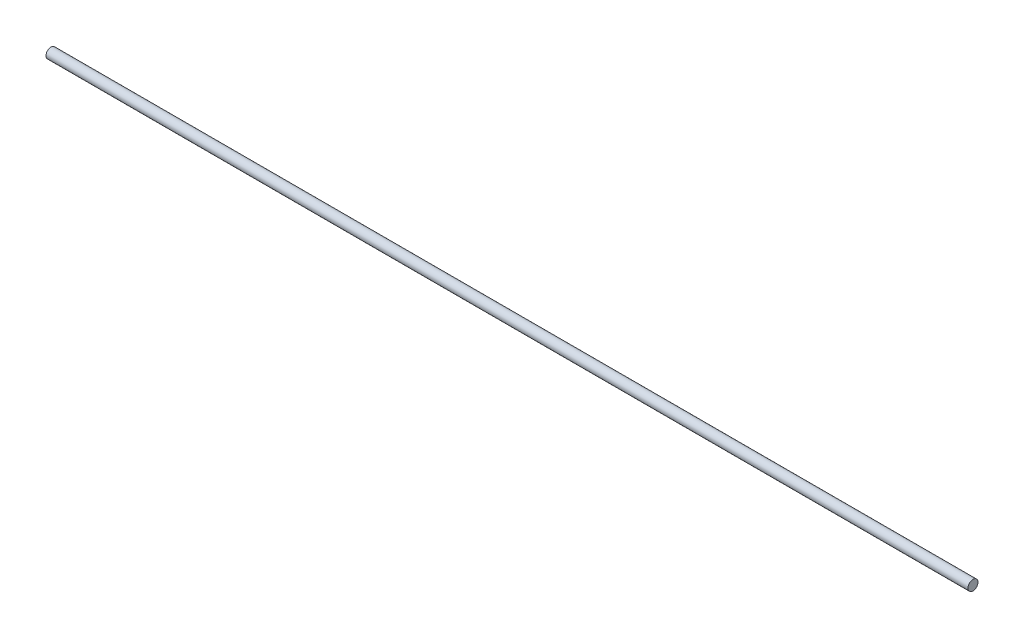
from build123d import *

# Parameters (mm, degrees)
SKETCH1_R              = 14.3256
N9_2_257IN_8_7FT_DEPTH = 1318.225


with BuildPart() as part:
    # Sketch1 → N9 - 2.257in - 8.7ft (new, symmetric)
    with BuildSketch(Plane.YZ):
        with Locations(Location((0, 0, 0), (0, 0, 270.000000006))):
            Circle(SKETCH1_R)
    extrude(amount=N9_2_257IN_8_7FT_DEPTH, both=True)


solid = part.part
